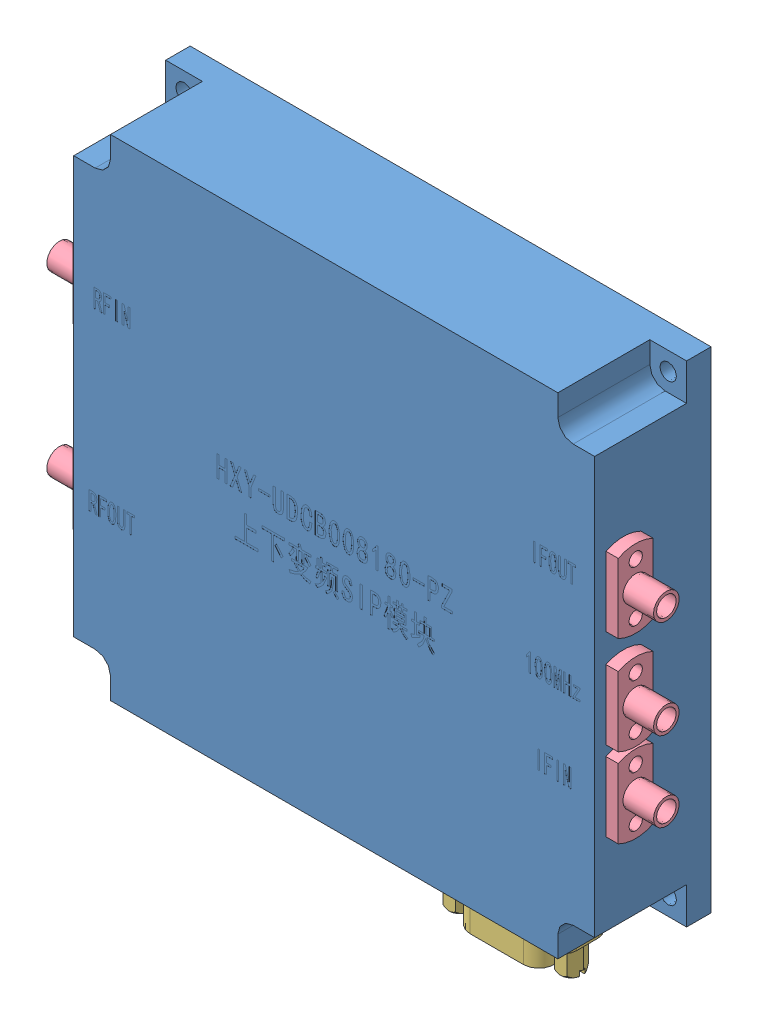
SolidWorks assembly 0.8-18G-PZ外形图.SLDASM, configuration Default (file format 6000). Lengths in mm.
Overall size (99 87.31 19.05).
12 component instances, 4 part files, 0 mates.
Components (placement in the parent):
- 上下变频SIP模块-1: 上下变频SIP模块.sldprt [默认] at origin size (85 80 19.05)
- SMP-RJ-4A6-1: SMP-RJ-4A6.sldprt [默认] at (41.5 14 14.3) x (-1 0 0) z (0 0.115562 -0.9933) size (5.2 3.7 3.7)
- SMP-RJ-4A6-2: SMP-RJ-4A6.sldprt [默认] at (-41.5 14 14.3) size (5.2 3.7 3.7)
- SMP-RJ-4A6-3: SMP-RJ-4A6.sldprt [默认] at (41.5 -2 14.3) x (-1 0 0) z (0 0.271591 -0.962413) size (5.2 3.7 3.7)
- SMP-RJ-4A6-4: SMP-RJ-4A6.sldprt [默认] at (41.5 -15 14.3) x (-1 0 0) z (0 0.391926 -0.919997) size (5.2 3.7 3.7)
- SMP-RJ-4A6-5: SMP-RJ-4A6.sldprt [默认] at (-41.5 -15 14.3) x (1 0 0) z (0 -0.158553 0.987351) size (5.2 3.7 3.7)
- J30J-15ZK-1: J30J-15ZK.sldprt [默认] at (22.82 -47.31 12.2) x (1 0 0) z (0 1 0) size (23.36 7.6 13.1)
- SMP-JFD60G-F(西安艾力特，不锈钢外壳，全擒纵，适配0.4插针）-1: SMP-JFD60G-F(西安艾力特，不锈钢外壳，全擒纵，适配0.4插针）.sldprt [默认] at (42.5 14 14.3) x (0 0 -1) z (1 0 0) size (5.7 12.7 7.1)
- SMP-JFD60G-F(西安艾力特，不锈钢外壳，全擒纵，适配0.4插针）-2: SMP-JFD60G-F(西安艾力特，不锈钢外壳，全擒纵，适配0.4插针）.sldprt [默认] at (42.5 -2 14.3) x (0 0 -1) z (1 0 0) size (5.7 12.7 7.1)
- SMP-JFD60G-F(西安艾力特，不锈钢外壳，全擒纵，适配0.4插针）-3: SMP-JFD60G-F(西安艾力特，不锈钢外壳，全擒纵，适配0.4插针）.sldprt [默认] at (42.5 -15 14.3) x (0 0 -1) z (1 0 0) size (5.7 12.7 7.1)
- SMP-JFD60G-F(西安艾力特，不锈钢外壳，全擒纵，适配0.4插针）-4: SMP-JFD60G-F(西安艾力特，不锈钢外壳，全擒纵，适配0.4插针）.sldprt [默认] at (-42.5 -15 14.3) x (0 0 1) z (-1 0 0) size (5.7 12.7 7.1)
- SMP-JFD60G-F(西安艾力特，不锈钢外壳，全擒纵，适配0.4插针）-5: SMP-JFD60G-F(西安艾力特，不锈钢外壳，全擒纵，适配0.4插针）.sldprt [默认] at (-42.5 14 14.3) x (0 0 1) z (-1 0 0) size (5.7 12.7 7.1)
